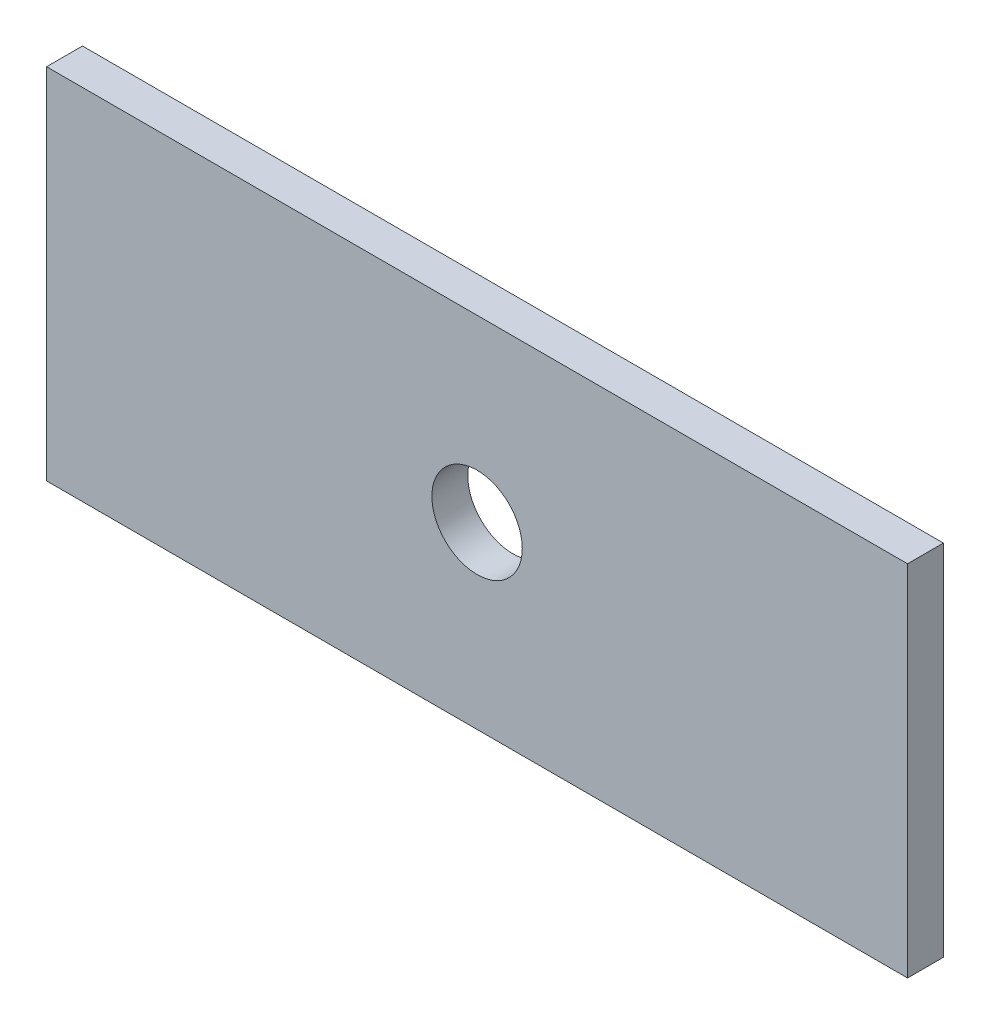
from build123d import *

# Parameters (mm, degrees)
SKETCH2_W           = 76.2
SKETCH2_H           = 31.75
BOSS_EXTRUDE1_DEPTH = 3.175
SKETCH3_R           = 4.0005
CUT_EXTRUDE1_DEPTH  = 83.611035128


with BuildPart() as part:
    # Sketch2 → Boss-Extrude1 (new body)
    with BuildSketch(Plane.XY):
        with Locations((38.1, 15.875)):
            Rectangle(SKETCH2_W, SKETCH2_H)
    extrude(amount=BOSS_EXTRUDE1_DEPTH)

    # Sketch3 → Cut-Extrude1 (cut, through all)
    with BuildSketch(Plane.XY.offset(3.175)):
        with Locations((38.1, 15.875)):
            Circle(SKETCH3_R)
    extrude(amount=-CUT_EXTRUDE1_DEPTH, mode=Mode.SUBTRACT)


solid = part.part
